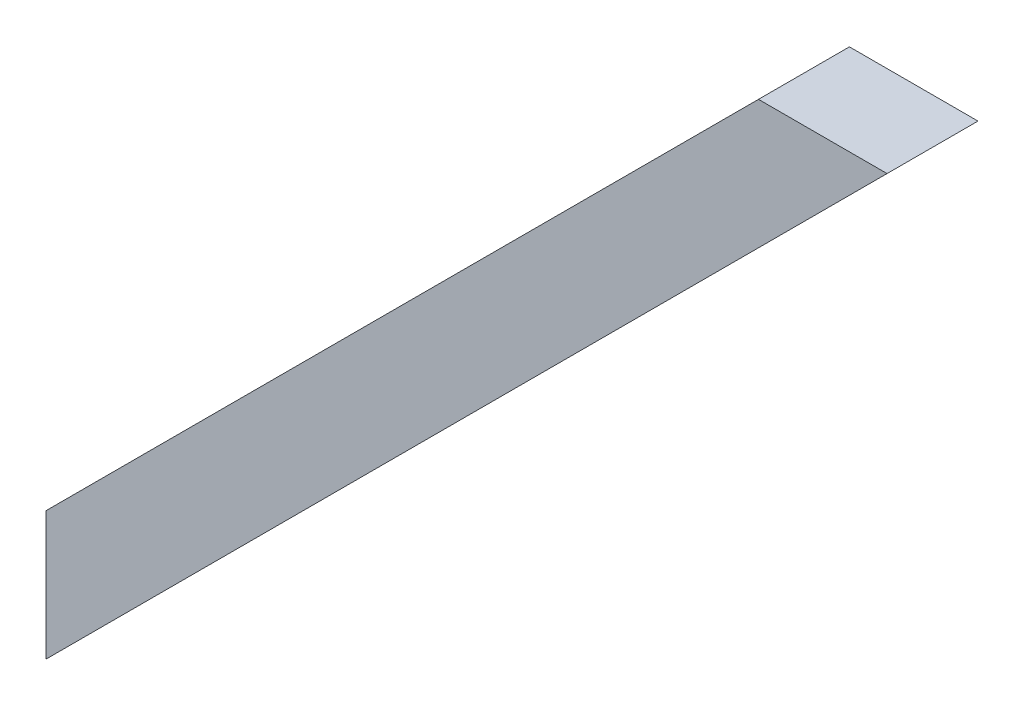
from build123d import *

# Parameters (mm, degrees)
BOSS_EXTRU_1_DEPTH = 40


with BuildPart() as part:
    # Esquisse1 → Boss.-Extru.1 (new body)
    with BuildSketch(Plane.XY):
        Polygon((0, 56.568542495), (313.431457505, 370), (370, 370), (0, 0), align=None)
    extrude(amount=-BOSS_EXTRU_1_DEPTH)


solid = part.part
